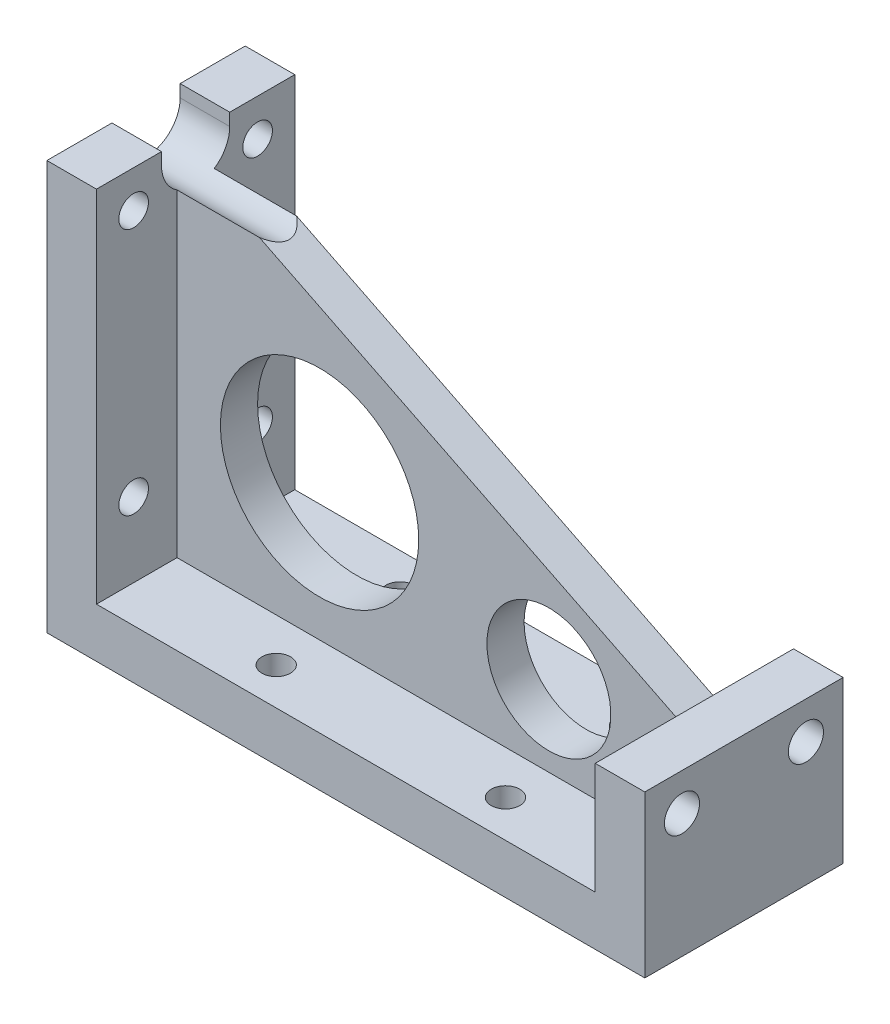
from build123d import *

# Parameters (mm, degrees)
BOSS_EXTRUDE1_DEPTH       = 12.7
SKETCH3_R                 = 12.7
SKETCH3_R_2               = 7.9375
BOSS_EXTRUDE2_DEPTH       = 2.38125
F_6_CLEARANCE_HOLE1_D     = 3.7973
F_6_CLEARANCE_HOLE1_DEPTH = 9.525
F_6_CLEARANCE_HOLE1_TIP   = 1.140824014
F_8_CLEARANCE_HOLE1_D     = 4.4958
F_8_CLEARANCE_HOLE1_DEPTH = 6.35
VENTSLOT_DEPTH            = 94.650358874
F_6_CLEARANCE_HOLE4_D     = 3.6576


with BuildPart() as part:
    # Sketch1 → Boss-Extrude1 (new, symmetric)
    with BuildSketch(Plane.XY):
        Polygon((0, 52.3875), (0, 0), (53.975, 0), (76.581, 0), (76.581, 20.6375), (70.231, 20.6375), (70.231, 6.35), (53.975, 6.35), (6.35, 6.35), (6.35, 52.3875), align=None)
    extrude(amount=BOSS_EXTRUDE1_DEPTH, both=True)

    # Sketch3 → Boss-Extrude2 (add, symmetric)
    with BuildSketch(Plane.XY):
        Polygon((53.975, 6.35), (6.35, 6.35), (6.35, 52.3875), (70.231, 20.6375), (70.231, 6.35), align=None)
        with Locations(Location((24.60625, 23.8125, 0), (0, 0, 180))):
            Circle(SKETCH3_R, mode=Mode.SUBTRACT)
        with Locations(Location((53.975, 16.66875, 0), (0, 0, 180))):
            Circle(SKETCH3_R_2, mode=Mode.SUBTRACT)
    extrude(amount=BOSS_EXTRUDE2_DEPTH, both=True)

    # 6 Clearance Hole1
    with Locations(Plane(origin=(6.35, 0, 0), x_dir=(0, 0, -1), z_dir=(1, 0, 0))):
        with Locations((-7.9375, 47.625), (7.9375, 47.625), (7.9375, 15.875), (-7.9375, 15.875)):
            Hole(F_6_CLEARANCE_HOLE1_D / 2, depth=F_6_CLEARANCE_HOLE1_DEPTH)
            with Locations((0, 0, -(F_6_CLEARANCE_HOLE1_DEPTH + F_6_CLEARANCE_HOLE1_TIP / 2))):  # 118° drill point
                Cone(0, F_6_CLEARANCE_HOLE1_D / 2, F_6_CLEARANCE_HOLE1_TIP, mode=Mode.SUBTRACT)

    # 8 Clearance Hole1
    with Locations(Plane(origin=(76.581, 0, 0), x_dir=(0, 0, -1), z_dir=(1, 0, 0))):
        with Locations((7.9375, 15.875), (-7.9375, 15.875)):
            Hole(F_8_CLEARANCE_HOLE1_D / 2, depth=F_8_CLEARANCE_HOLE1_DEPTH)

    # Sketch8 → VentSlot (cut, through all)
    with BuildSketch(Plane.ZY):
        with BuildLine():
            Line((-4.3688, 52.3875), (4.3688, 52.3875))
            Line((4.3688, 52.3875), (4.3688, 50.8))
            ThreePointArc((4.3688, 50.8), (0, 46.4312), (-4.3688, 50.8))
            Line((-4.3688, 50.8), (-4.3688, 52.3875))
        make_face()
    extrude(amount=-VENTSLOT_DEPTH, mode=Mode.SUBTRACT)

    # 6 Clearance Hole4 (through all)
    with Locations(Plane(origin=(0, 6.35, 0), x_dir=(1, 0, 0), z_dir=(0, 1, 0))):
        with Locations((6.884298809, -405.351535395), (53.975, -7.9375), (24.60625, -7.9375), (24.60625, 7.9375), (53.975, 7.9375)):
            Hole(F_6_CLEARANCE_HOLE4_D / 2)


solid = part.part
